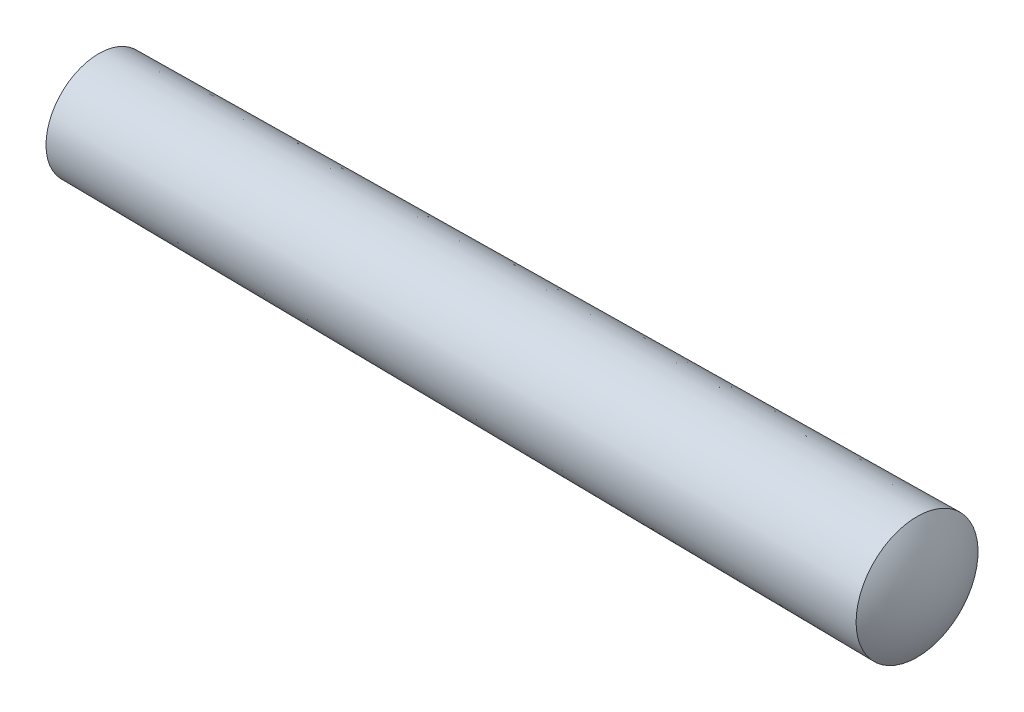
ISO-10303-21;
HEADER;
FILE_DESCRIPTION(('STEP AP214'),'2;1');
FILE_NAME('part.step','',(''),(''),'','','');
FILE_SCHEMA(('AUTOMOTIVE_DESIGN { 1 0 10303 214 1 1 1 1 }'));
ENDSEC;
DATA;
#1=APPLICATION_CONTEXT('core data for automotive mechanical design processes');
#2=APPLICATION_PROTOCOL_DEFINITION('international standard','automotive_design',2000,#1);
#3=PRODUCT_CONTEXT('',#1,'mechanical');
#4=PRODUCT('Part','Part','',(#3));
#5=PRODUCT_RELATED_PRODUCT_CATEGORY('part','',(#4));
#6=PRODUCT_DEFINITION_FORMATION('','',#4);
#7=PRODUCT_DEFINITION_CONTEXT('part definition',#1,'design');
#8=PRODUCT_DEFINITION('design','',#6,#7);
#9=PRODUCT_DEFINITION_SHAPE('','',#8);
#10=(LENGTH_UNIT() NAMED_UNIT(*) SI_UNIT(.MILLI.,.METRE.));
#11=(NAMED_UNIT(*) PLANE_ANGLE_UNIT() SI_UNIT($,.RADIAN.));
#12=(NAMED_UNIT(*) SI_UNIT($,.STERADIAN.) SOLID_ANGLE_UNIT());
#13=UNCERTAINTY_MEASURE_WITH_UNIT(LENGTH_MEASURE(1.E-05),#10,'distance_accuracy_value','');
#14=(GEOMETRIC_REPRESENTATION_CONTEXT(3) GLOBAL_UNCERTAINTY_ASSIGNED_CONTEXT((#13)) GLOBAL_UNIT_ASSIGNED_CONTEXT((#10,
#11,#12)) REPRESENTATION_CONTEXT('',''));
#15=CARTESIAN_POINT('',(0.,0.,0.));
#16=DIRECTION('',(0.,0.,1.));
#17=DIRECTION('',(1.,0.,0.));
#18=AXIS2_PLACEMENT_3D('',#15,#16,#17);
#19=CARTESIAN_POINT('',(34.657975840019,0.,0.));
#20=DIRECTION('',(-1.,0.,0.));
#21=DIRECTION('',(0.,-1.,0.));
#22=AXIS2_PLACEMENT_3D('',#19,#20,#21);
#23=SPHERICAL_SURFACE('',#22,5.);
#24=CARTESIAN_POINT('',(38.74,0.,0.));
#25=DIRECTION('',(-1.,0.,0.));
#26=DIRECTION('',(0.,0.,1.));
#27=AXIS2_PLACEMENT_3D('',#24,#25,#26);
#28=CIRCLE('',#27,2.88739999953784);
#29=CARTESIAN_POINT('',(38.74,0.,2.88739999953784));
#30=VERTEX_POINT('',#29);
#31=EDGE_CURVE('E37',#30,#30,#28,.T.);
#32=ORIENTED_EDGE('',*,*,#31,.F.);
#33=EDGE_LOOP('',(#32));
#34=FACE_BOUND('',#33,.T.);
#35=ADVANCED_FACE('F31',(#34),#23,.T.);
#36=CARTESIAN_POINT('',(4.33012701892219,0.,0.));
#37=DIRECTION('',(-1.,0.,0.));
#38=DIRECTION('',(0.,1.,0.));
#39=AXIS2_PLACEMENT_3D('',#36,#37,#38);
#40=SPHERICAL_SURFACE('',#39,5.);
#41=CARTESIAN_POINT('',(0.,0.,0.));
#42=DIRECTION('',(-1.,0.,0.));
#43=DIRECTION('',(0.,0.,1.));
#44=AXIS2_PLACEMENT_3D('',#41,#42,#43);
#45=CIRCLE('',#44,2.5);
#46=CARTESIAN_POINT('',(0.,0.,2.5));
#47=VERTEX_POINT('',#46);
#48=EDGE_CURVE('E10',#47,#47,#45,.T.);
#49=ORIENTED_EDGE('',*,*,#48,.T.);
#50=EDGE_LOOP('',(#49));
#51=FACE_BOUND('',#50,.T.);
#52=ADVANCED_FACE('F46',(#51),#40,.T.);
#53=CARTESIAN_POINT('',(38.74,0.,0.));
#54=DIRECTION('',(1.,0.,0.));
#55=DIRECTION('',(0.,0.,-1.));
#56=AXIS2_PLACEMENT_3D('',#53,#54,#55);
#57=CONICAL_SURFACE('',#56,2.88739999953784,0.00999966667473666);
#58=ORIENTED_EDGE('',*,*,#48,.F.);
#59=EDGE_LOOP('',(#58));
#60=FACE_BOUND('',#59,.T.);
#61=ORIENTED_EDGE('',*,*,#31,.T.);
#62=EDGE_LOOP('',(#61));
#63=FACE_BOUND('',#62,.T.);
#64=ADVANCED_FACE('F43',(#60,#63),#57,.T.);
#65=CLOSED_SHELL('',(#35,#52,#64));
#66=MANIFOLD_SOLID_BREP('B2',#65);
#67=ADVANCED_BREP_SHAPE_REPRESENTATION('',(#18,#66),#14);
#68=SHAPE_DEFINITION_REPRESENTATION(#9,#67);
ENDSEC;
END-ISO-10303-21;
